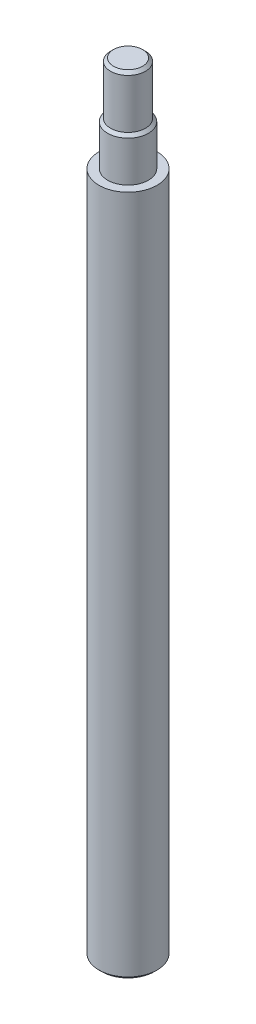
ISO-10303-21;
HEADER;
FILE_DESCRIPTION(('STEP AP214'),'2;1');
FILE_NAME('part.step','',(''),(''),'','','');
FILE_SCHEMA(('AUTOMOTIVE_DESIGN { 1 0 10303 214 1 1 1 1 }'));
ENDSEC;
DATA;
#1=APPLICATION_CONTEXT('core data for automotive mechanical design processes');
#2=APPLICATION_PROTOCOL_DEFINITION('international standard','automotive_design',2000,#1);
#3=PRODUCT_CONTEXT('',#1,'mechanical');
#4=PRODUCT('Part','Part','',(#3));
#5=PRODUCT_RELATED_PRODUCT_CATEGORY('part','',(#4));
#6=PRODUCT_DEFINITION_FORMATION('','',#4);
#7=PRODUCT_DEFINITION_CONTEXT('part definition',#1,'design');
#8=PRODUCT_DEFINITION('design','',#6,#7);
#9=PRODUCT_DEFINITION_SHAPE('','',#8);
#10=(LENGTH_UNIT() NAMED_UNIT(*) SI_UNIT(.MILLI.,.METRE.));
#11=(NAMED_UNIT(*) PLANE_ANGLE_UNIT() SI_UNIT($,.RADIAN.));
#12=(NAMED_UNIT(*) SI_UNIT($,.STERADIAN.) SOLID_ANGLE_UNIT());
#13=UNCERTAINTY_MEASURE_WITH_UNIT(LENGTH_MEASURE(1.E-05),#10,'distance_accuracy_value','');
#14=(GEOMETRIC_REPRESENTATION_CONTEXT(3) GLOBAL_UNCERTAINTY_ASSIGNED_CONTEXT((#13)) GLOBAL_UNIT_ASSIGNED_CONTEXT((#10,
#11,#12)) REPRESENTATION_CONTEXT('',''));
#15=CARTESIAN_POINT('',(0.,0.,0.));
#16=DIRECTION('',(0.,0.,1.));
#17=DIRECTION('',(1.,0.,0.));
#18=AXIS2_PLACEMENT_3D('',#15,#16,#17);
#19=CARTESIAN_POINT('',(0.,235.,0.));
#20=DIRECTION('',(0.,-1.,0.));
#21=DIRECTION('',(0.,0.,-1.));
#22=AXIS2_PLACEMENT_3D('',#19,#20,#21);
#23=CYLINDRICAL_SURFACE('',#22,10.);
#24=CARTESIAN_POINT('',(0.,1.0000000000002,0.));
#25=DIRECTION('',(0.,1.,0.));
#26=DIRECTION('',(0.,0.,1.));
#27=AXIS2_PLACEMENT_3D('',#24,#25,#26);
#28=CIRCLE('',#27,10.);
#29=CARTESIAN_POINT('',(0.,1.0000000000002,-10.));
#30=VERTEX_POINT('',#29);
#31=EDGE_CURVE('E54',#30,#30,#28,.T.);
#32=CARTESIAN_POINT('',(0.,235.,0.));
#33=DIRECTION('',(0.,1.,0.));
#34=DIRECTION('',(0.,0.,1.));
#35=AXIS2_PLACEMENT_3D('',#32,#33,#34);
#36=CIRCLE('',#35,10.);
#37=CARTESIAN_POINT('',(0.,235.,-10.));
#38=VERTEX_POINT('',#37);
#39=EDGE_CURVE('E57',#38,#38,#36,.T.);
#40=CARTESIAN_POINT('',(0.,1.0000000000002,-10.));
#41=CARTESIAN_POINT('',(0.,3.43750000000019,-10.));
#42=CARTESIAN_POINT('',(0.,5.87500000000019,-10.));
#43=CARTESIAN_POINT('',(0.,10.7500000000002,-10.));
#44=CARTESIAN_POINT('',(0.,13.1875000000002,-10.));
#45=CARTESIAN_POINT('',(0.,18.0625000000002,-10.));
#46=CARTESIAN_POINT('',(0.,20.5000000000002,-10.));
#47=CARTESIAN_POINT('',(0.,25.3750000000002,-10.));
#48=CARTESIAN_POINT('',(0.,27.8125000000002,-10.));
#49=CARTESIAN_POINT('',(0.,32.6875000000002,-10.));
#50=CARTESIAN_POINT('',(0.,35.1250000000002,-10.));
#51=CARTESIAN_POINT('',(0.,40.0000000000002,-10.));
#52=CARTESIAN_POINT('',(0.,42.4375000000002,-10.));
#53=CARTESIAN_POINT('',(0.,47.3125000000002,-10.));
#54=CARTESIAN_POINT('',(0.,49.7500000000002,-10.));
#55=CARTESIAN_POINT('',(0.,54.6250000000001,-10.));
#56=CARTESIAN_POINT('',(0.,57.0625000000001,-10.));
#57=CARTESIAN_POINT('',(0.,61.9375000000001,-10.));
#58=CARTESIAN_POINT('',(0.,64.3750000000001,-10.));
#59=CARTESIAN_POINT('',(0.,69.2500000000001,-10.));
#60=CARTESIAN_POINT('',(0.,71.6875000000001,-10.));
#61=CARTESIAN_POINT('',(0.,76.5625000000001,-10.));
#62=CARTESIAN_POINT('',(0.,79.0000000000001,-10.));
#63=CARTESIAN_POINT('',(0.,83.8750000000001,-10.));
#64=CARTESIAN_POINT('',(0.,86.3125000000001,-10.));
#65=CARTESIAN_POINT('',(0.,91.1875000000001,-10.));
#66=CARTESIAN_POINT('',(0.,93.6250000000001,-10.));
#67=CARTESIAN_POINT('',(0.,98.5000000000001,-10.));
#68=CARTESIAN_POINT('',(0.,100.9375,-10.));
#69=CARTESIAN_POINT('',(0.,105.8125,-10.));
#70=CARTESIAN_POINT('',(0.,108.25,-10.));
#71=CARTESIAN_POINT('',(0.,113.125,-10.));
#72=CARTESIAN_POINT('',(0.,115.5625,-10.));
#73=CARTESIAN_POINT('',(0.,120.4375,-10.));
#74=CARTESIAN_POINT('',(0.,122.875,-10.));
#75=CARTESIAN_POINT('',(0.,127.75,-10.));
#76=CARTESIAN_POINT('',(0.,130.1875,-10.));
#77=CARTESIAN_POINT('',(0.,135.0625,-10.));
#78=CARTESIAN_POINT('',(0.,137.5,-10.));
#79=CARTESIAN_POINT('',(0.,142.375,-10.));
#80=CARTESIAN_POINT('',(0.,144.8125,-10.));
#81=CARTESIAN_POINT('',(0.,149.6875,-10.));
#82=CARTESIAN_POINT('',(0.,152.125,-10.));
#83=CARTESIAN_POINT('',(0.,157.,-10.));
#84=CARTESIAN_POINT('',(0.,159.4375,-10.));
#85=CARTESIAN_POINT('',(0.,164.3125,-10.));
#86=CARTESIAN_POINT('',(0.,166.75,-10.));
#87=CARTESIAN_POINT('',(0.,171.625,-10.));
#88=CARTESIAN_POINT('',(0.,174.0625,-10.));
#89=CARTESIAN_POINT('',(0.,178.9375,-10.));
#90=CARTESIAN_POINT('',(0.,181.375,-10.));
#91=CARTESIAN_POINT('',(0.,186.25,-10.));
#92=CARTESIAN_POINT('',(0.,188.6875,-10.));
#93=CARTESIAN_POINT('',(0.,193.5625,-10.));
#94=CARTESIAN_POINT('',(0.,196.,-10.));
#95=CARTESIAN_POINT('',(0.,200.875,-10.));
#96=CARTESIAN_POINT('',(0.,203.3125,-10.));
#97=CARTESIAN_POINT('',(0.,208.1875,-10.));
#98=CARTESIAN_POINT('',(0.,210.625,-10.));
#99=CARTESIAN_POINT('',(0.,215.5,-10.));
#100=CARTESIAN_POINT('',(0.,217.9375,-10.));
#101=CARTESIAN_POINT('',(0.,222.8125,-10.));
#102=CARTESIAN_POINT('',(0.,225.25,-10.));
#103=CARTESIAN_POINT('',(0.,230.125,-10.));
#104=CARTESIAN_POINT('',(0.,232.5625,-10.));
#105=CARTESIAN_POINT('',(0.,235.,-10.));
#106=B_SPLINE_CURVE_WITH_KNOTS('',3,(#40,#41,#42,#43,#44,#45,#46,#47,#48,#49,#50,#51,#52,#53,
#54,#55,#56,#57,#58,#59,#60,#61,#62,#63,#64,#65,#66,#67,#68,#69,#70,#71,#72,#73,#74,#75,#76,#77,
#78,#79,#80,#81,#82,#83,#84,#85,#86,#87,#88,#89,#90,#91,#92,#93,#94,#95,#96,#97,#98,#99,#100,
#101,#102,#103,#104,#105),.UNSPECIFIED.,.F.,.F.,(4,2,2,2,2,2,2,2,2,2,2,2,2,2,2,2,2,2,2,2,2,2,2,
2,2,2,2,2,2,2,2,2,4),(0.,7.3125,14.625,21.9375,29.25,36.5625,43.875,51.1875,58.4999999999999,
65.8124999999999,73.1249999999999,80.4374999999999,87.7499999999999,95.0624999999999,102.375,
109.6875,117.,124.3125,131.625,138.9375,146.25,153.5625,160.875,168.1875,175.5,182.8125,190.125,
197.4375,204.75,212.0625,219.375,226.6875,234.),.UNSPECIFIED.);
#107=EDGE_CURVE('BSEAM34',#30,#38,#106,.T.);
#108=ORIENTED_EDGE('',*,*,#31,.T.);
#109=ORIENTED_EDGE('',*,*,#39,.F.);
#110=ORIENTED_EDGE('',*,*,#107,.T.);
#111=ORIENTED_EDGE('',*,*,#107,.F.);
#112=EDGE_LOOP('',(#108,#110,#109,#111));
#113=FACE_BOUND('',#112,.T.);
#114=ADVANCED_FACE('F34',(#113),#23,.T.);
#115=CARTESIAN_POINT('',(0.,235.,0.));
#116=DIRECTION('',(0.,1.,0.));
#117=DIRECTION('',(0.,0.,1.));
#118=AXIS2_PLACEMENT_3D('',#115,#116,#117);
#119=PLANE('',#118);
#120=CARTESIAN_POINT('',(0.,235.,0.));
#121=DIRECTION('',(0.,1.,0.));
#122=DIRECTION('',(0.,0.,1.));
#123=AXIS2_PLACEMENT_3D('',#120,#121,#122);
#124=CIRCLE('',#123,7.);
#125=CARTESIAN_POINT('',(0.,235.,7.));
#126=VERTEX_POINT('',#125);
#127=EDGE_CURVE('E60',#126,#126,#124,.T.);
#128=ORIENTED_EDGE('',*,*,#127,.F.);
#129=EDGE_LOOP('',(#128));
#130=FACE_BOUND('',#129,.T.);
#131=ORIENTED_EDGE('',*,*,#39,.T.);
#132=EDGE_LOOP('',(#131));
#133=FACE_BOUND('',#132,.T.);
#134=ADVANCED_FACE('F78',(#130,#133),#119,.T.);
#135=CARTESIAN_POINT('',(0.,0.,0.));
#136=DIRECTION('',(0.,1.,0.));
#137=DIRECTION('',(0.,0.,1.));
#138=AXIS2_PLACEMENT_3D('',#135,#136,#137);
#139=PLANE('',#138);
#140=CARTESIAN_POINT('',(0.,0.,0.));
#141=DIRECTION('',(0.,1.,0.));
#142=DIRECTION('',(0.,0.,1.));
#143=AXIS2_PLACEMENT_3D('',#140,#141,#142);
#144=CIRCLE('',#143,8.99999999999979);
#145=CARTESIAN_POINT('',(0.,0.,8.99999999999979));
#146=VERTEX_POINT('',#145);
#147=EDGE_CURVE('E49',#146,#146,#144,.F.);
#148=ORIENTED_EDGE('',*,*,#147,.T.);
#149=EDGE_LOOP('',(#148));
#150=FACE_BOUND('',#149,.T.);
#151=ADVANCED_FACE('F84',(#150),#139,.F.);
#152=CARTESIAN_POINT('',(0.,250.,0.));
#153=DIRECTION('',(0.,-1.,0.));
#154=DIRECTION('',(0.,0.,-1.));
#155=AXIS2_PLACEMENT_3D('',#152,#153,#154);
#156=CYLINDRICAL_SURFACE('',#155,7.);
#157=CARTESIAN_POINT('',(0.,249.,0.));
#158=DIRECTION('',(0.,1.,0.));
#159=DIRECTION('',(0.,0.,1.));
#160=AXIS2_PLACEMENT_3D('',#157,#158,#159);
#161=CIRCLE('',#160,7.);
#162=CARTESIAN_POINT('',(0.,249.,7.));
#163=VERTEX_POINT('',#162);
#164=EDGE_CURVE('E10',#163,#163,#161,.F.);
#165=ORIENTED_EDGE('',*,*,#164,.T.);
#166=EDGE_LOOP('',(#165));
#167=FACE_BOUND('',#166,.T.);
#168=ORIENTED_EDGE('',*,*,#127,.T.);
#169=EDGE_LOOP('',(#168));
#170=FACE_BOUND('',#169,.T.);
#171=ADVANCED_FACE('F103',(#167,#170),#156,.T.);
#172=CARTESIAN_POINT('',(0.,268.,0.));
#173=DIRECTION('',(0.,-1.,0.));
#174=DIRECTION('',(0.,0.,-1.));
#175=AXIS2_PLACEMENT_3D('',#172,#173,#174);
#176=CYLINDRICAL_SURFACE('',#175,6.);
#177=CARTESIAN_POINT('',(0.,267.,0.));
#178=DIRECTION('',(0.,1.,0.));
#179=DIRECTION('',(0.,0.,1.));
#180=AXIS2_PLACEMENT_3D('',#177,#178,#179);
#181=CIRCLE('',#180,6.);
#182=CARTESIAN_POINT('',(0.,267.,6.));
#183=VERTEX_POINT('',#182);
#184=EDGE_CURVE('E41',#183,#183,#181,.F.);
#185=ORIENTED_EDGE('',*,*,#184,.T.);
#186=EDGE_LOOP('',(#185));
#187=FACE_BOUND('',#186,.T.);
#188=CARTESIAN_POINT('',(0.,250.,0.));
#189=DIRECTION('',(0.,1.,0.));
#190=DIRECTION('',(0.,0.,1.));
#191=AXIS2_PLACEMENT_3D('',#188,#189,#190);
#192=CIRCLE('',#191,6.);
#193=CARTESIAN_POINT('',(0.,250.,6.));
#194=VERTEX_POINT('',#193);
#195=EDGE_CURVE('E63',#194,#194,#192,.T.);
#196=ORIENTED_EDGE('',*,*,#195,.T.);
#197=EDGE_LOOP('',(#196));
#198=FACE_BOUND('',#197,.T.);
#199=ADVANCED_FACE('F67',(#187,#198),#176,.T.);
#200=CARTESIAN_POINT('',(0.,268.,0.));
#201=DIRECTION('',(0.,1.,0.));
#202=DIRECTION('',(0.,0.,1.));
#203=AXIS2_PLACEMENT_3D('',#200,#201,#202);
#204=PLANE('',#203);
#205=CARTESIAN_POINT('',(0.,268.,0.));
#206=DIRECTION('',(0.,1.,0.));
#207=DIRECTION('',(0.,0.,1.));
#208=AXIS2_PLACEMENT_3D('',#205,#206,#207);
#209=CIRCLE('',#208,4.99999999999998);
#210=CARTESIAN_POINT('',(0.,268.,4.99999999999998));
#211=VERTEX_POINT('',#210);
#212=EDGE_CURVE('E45',#211,#211,#209,.T.);
#213=ORIENTED_EDGE('',*,*,#212,.T.);
#214=EDGE_LOOP('',(#213));
#215=FACE_BOUND('',#214,.T.);
#216=ADVANCED_FACE('F91',(#215),#204,.T.);
#217=CARTESIAN_POINT('',(0.,1.0000000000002,0.));
#218=DIRECTION('',(0.,1.,0.));
#219=DIRECTION('',(0.,0.,1.));
#220=AXIS2_PLACEMENT_3D('',#217,#218,#219);
#221=CONICAL_SURFACE('',#220,10.,0.785398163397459);
#222=ORIENTED_EDGE('',*,*,#147,.F.);
#223=EDGE_LOOP('',(#222));
#224=FACE_BOUND('',#223,.T.);
#225=ORIENTED_EDGE('',*,*,#31,.F.);
#226=EDGE_LOOP('',(#225));
#227=FACE_BOUND('',#226,.T.);
#228=ADVANCED_FACE('F75',(#224,#227),#221,.T.);
#229=CARTESIAN_POINT('',(0.,268.,0.));
#230=DIRECTION('',(0.,-1.,0.));
#231=DIRECTION('',(0.,0.,-1.));
#232=AXIS2_PLACEMENT_3D('',#229,#230,#231);
#233=CONICAL_SURFACE('',#232,4.99999999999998,0.78539816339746);
#234=ORIENTED_EDGE('',*,*,#184,.F.);
#235=EDGE_LOOP('',(#234));
#236=FACE_BOUND('',#235,.T.);
#237=ORIENTED_EDGE('',*,*,#212,.F.);
#238=EDGE_LOOP('',(#237));
#239=FACE_BOUND('',#238,.T.);
#240=ADVANCED_FACE('F70',(#236,#239),#233,.T.);
#241=CARTESIAN_POINT('',(0.,250.,0.));
#242=DIRECTION('',(0.,-1.,0.));
#243=DIRECTION('',(0.,0.,-1.));
#244=AXIS2_PLACEMENT_3D('',#241,#242,#243);
#245=CONICAL_SURFACE('',#244,6.00000000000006,0.785398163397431);
#246=ORIENTED_EDGE('',*,*,#164,.F.);
#247=EDGE_LOOP('',(#246));
#248=FACE_BOUND('',#247,.T.);
#249=ORIENTED_EDGE('',*,*,#195,.F.);
#250=EDGE_LOOP('',(#249));
#251=FACE_BOUND('',#250,.T.);
#252=ADVANCED_FACE('F36',(#248,#251),#245,.T.);
#253=CLOSED_SHELL('',(#114,#134,#151,#171,#199,#216,#228,#240,#252));
#254=MANIFOLD_SOLID_BREP('B2',#253);
#255=ADVANCED_BREP_SHAPE_REPRESENTATION('',(#18,#254),#14);
#256=SHAPE_DEFINITION_REPRESENTATION(#9,#255);
ENDSEC;
END-ISO-10303-21;
